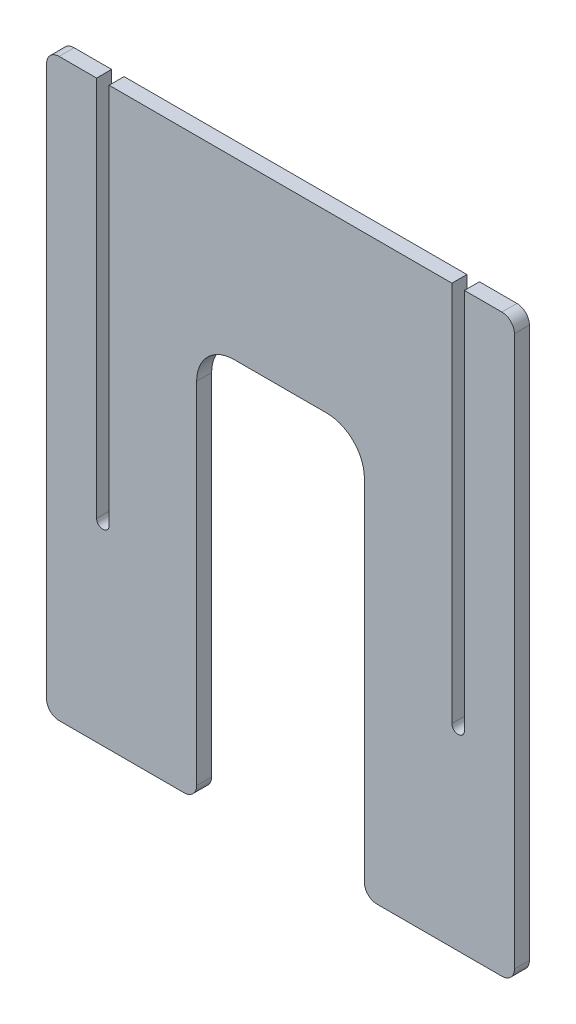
from build123d import *

# Parameters (mm, degrees)
BOSS_EXTRUDE2_DEPTH = 12
FILLET3_R           = 10
FILLET4_R           = 30


with BuildPart() as part:
    # Sketch1 → Boss-Extrude2 (new body)
    with BuildSketch(Plane.XY):
        with BuildLine():
            ThreePointArc((205.857822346, -283.451425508), (210.857822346, -288.451425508), (215.857822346, -283.451425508))
            Line((215.857822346, -283.451425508), (215.857822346, 21.548574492))
            Line((215.857822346, 21.548574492), (255.857822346, 21.548574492))
            Line((255.857822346, 21.548574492), (255.857822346, -438.451425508))
            Line((255.857822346, -438.451425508), (135.857822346, -438.451425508))
            Line((135.857822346, -438.451425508), (135.857822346, -118.451425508))
            Line((135.857822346, -118.451425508), (1.717822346, -118.451425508))
            Line((1.717822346, -118.451425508), (1.717822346, -438.451425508))
            Line((1.717822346, -438.451425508), (-118.282177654, -438.451425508))
            Line((-118.282177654, -438.451425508), (-118.282177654, 21.548574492))
            Line((-118.282177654, 21.548574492), (-78.282177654, 21.548574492))
            Line((-78.282177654, 21.548574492), (-78.282177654, -283.451425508))
            ThreePointArc((-78.282177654, -283.451425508), (-73.282177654, -288.451425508), (-68.282177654, -283.451425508))
            Line((-68.282177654, -283.451425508), (-68.282177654, 21.548574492))
            Line((-68.282177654, 21.548574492), (205.857822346, 21.548574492))
            Line((205.857822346, 21.548574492), (205.857822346, -283.451425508))
        make_face()
    extrude(amount=BOSS_EXTRUDE2_DEPTH)

    # Fillet3
    fillet3_edges = [part.edges().sort_by_distance(p)[0] for p in [
        (255.857822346, 21.548574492, 6),
        (255.857822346, -438.451425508, 6),
        (135.857822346, -438.451425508, 6),
        (1.717822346, -438.451425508, 6),
        (-118.282177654, -438.451425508, 6),
        (-118.282177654, 21.548574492, 6),
    ]]
    fillet(fillet3_edges, radius=FILLET3_R)

    # Fillet4
    fillet4_edges = [part.edges().sort_by_distance(p)[0] for p in [
        (135.857822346, -118.451425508, 6),
        (1.717822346, -118.451425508, 6),
    ]]
    fillet(fillet4_edges, radius=FILLET4_R)


solid = part.part
